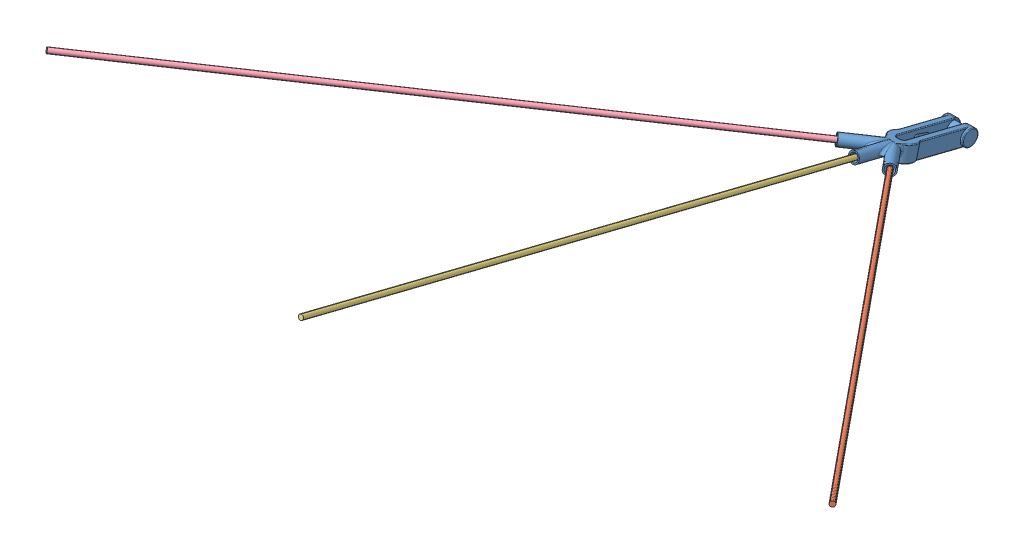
SolidWorks assembly TAIL.sldasm, configuration Default (file format 11000). Lengths in mm.
Overall size (95.59 21.49 80.59).
4 component instances, 4 part files, 0 mates.
Components (placement in the parent):
- TAIL_STRUCT-1: TAIL_STRUCT.sldprt [Default] at origin size (7.42 5.11 13.73)
- CRP_POLE_TAIL_1-1: CRP_POLE_TAIL_1.sldprt [Default] at origin size (47.38 14.14 54.66)
- CRP_POLE_TAIL_MIDDLE-1: CRP_POLE_TAIL_MIDDLE.sldprt [Default] at origin size (0.6 18.27 70.97)
- CRP_POLE_TAIL-1: CRP_POLE_TAIL.sldprt [Default] at origin size (47.38 14.14 54.66)
